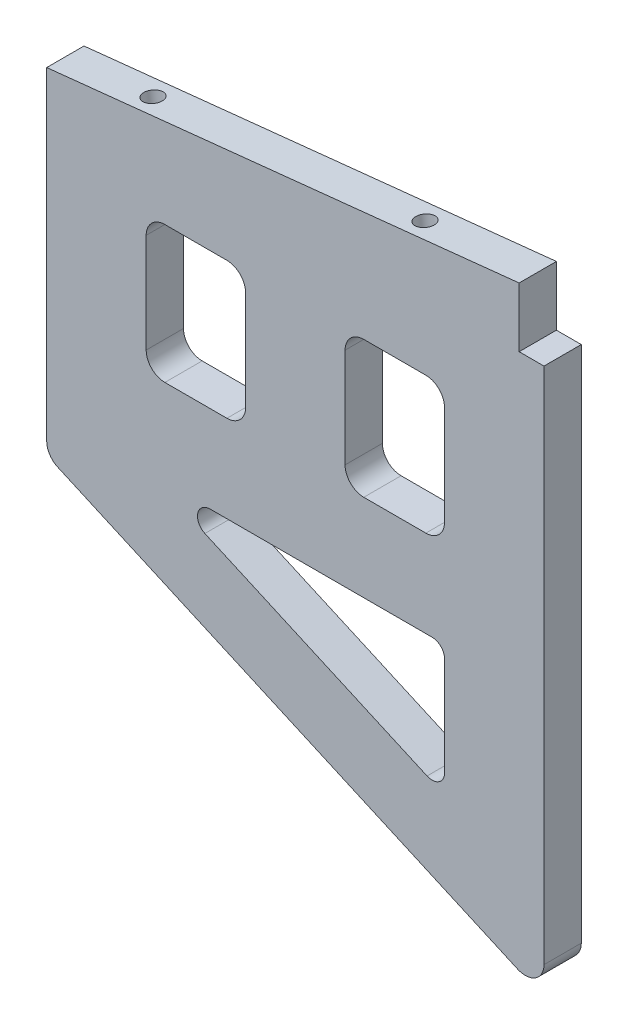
ISO-10303-21;
HEADER;
FILE_DESCRIPTION(('STEP AP214'),'2;1');
FILE_NAME('part.step','',(''),(''),'','','');
FILE_SCHEMA(('AUTOMOTIVE_DESIGN { 1 0 10303 214 1 1 1 1 }'));
ENDSEC;
DATA;
#1=APPLICATION_CONTEXT('core data for automotive mechanical design processes');
#2=APPLICATION_PROTOCOL_DEFINITION('international standard','automotive_design',2000,#1);
#3=PRODUCT_CONTEXT('',#1,'mechanical');
#4=PRODUCT('Part','Part','',(#3));
#5=PRODUCT_RELATED_PRODUCT_CATEGORY('part','',(#4));
#6=PRODUCT_DEFINITION_FORMATION('','',#4);
#7=PRODUCT_DEFINITION_CONTEXT('part definition',#1,'design');
#8=PRODUCT_DEFINITION('design','',#6,#7);
#9=PRODUCT_DEFINITION_SHAPE('','',#8);
#10=(LENGTH_UNIT() NAMED_UNIT(*) SI_UNIT(.MILLI.,.METRE.));
#11=(NAMED_UNIT(*) PLANE_ANGLE_UNIT() SI_UNIT($,.RADIAN.));
#12=(NAMED_UNIT(*) SI_UNIT($,.STERADIAN.) SOLID_ANGLE_UNIT());
#13=UNCERTAINTY_MEASURE_WITH_UNIT(LENGTH_MEASURE(1.E-05),#10,'distance_accuracy_value','');
#14=(GEOMETRIC_REPRESENTATION_CONTEXT(3) GLOBAL_UNCERTAINTY_ASSIGNED_CONTEXT((#13)) GLOBAL_UNIT_ASSIGNED_CONTEXT((#10,
#11,#12)) REPRESENTATION_CONTEXT('',''));
#15=CARTESIAN_POINT('',(0.,0.,0.));
#16=DIRECTION('',(0.,0.,1.));
#17=DIRECTION('',(1.,0.,0.));
#18=AXIS2_PLACEMENT_3D('',#15,#16,#17);
#19=CARTESIAN_POINT('',(0.,0.,4.7625));
#20=DIRECTION('',(0.,0.,1.));
#21=DIRECTION('',(1.,0.,0.));
#22=AXIS2_PLACEMENT_3D('',#19,#20,#21);
#23=PLANE('',#22);
#24=DIRECTION('',(1.,0.,0.));
#25=VECTOR('',#24,1.);
#26=CARTESIAN_POINT('',(25.4,-54.5576133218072,4.7625));
#27=LINE('',#26,#25);
#28=CARTESIAN_POINT('',(30.1752,-54.5576133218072,4.7625));
#29=VERTEX_POINT('',#28);
#30=CARTESIAN_POINT('',(46.0248,-54.5576133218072,4.7625));
#31=VERTEX_POINT('',#30);
#32=EDGE_CURVE('E285',#29,#31,#27,.T.);
#33=ORIENTED_EDGE('',*,*,#32,.F.);
#34=CARTESIAN_POINT('',(30.1752,-49.7824133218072,4.7625));
#35=DIRECTION('',(0.,0.,1.));
#36=DIRECTION('',(1.,0.,0.));
#37=AXIS2_PLACEMENT_3D('',#34,#35,#36);
#38=CIRCLE('',#37,4.7752);
#39=CARTESIAN_POINT('',(25.4,-49.7824133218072,4.7625));
#40=VERTEX_POINT('',#39);
#41=EDGE_CURVE('E452',#29,#40,#38,.F.);
#42=ORIENTED_EDGE('',*,*,#41,.T.);
#43=DIRECTION('',(0.,-1.,0.));
#44=VECTOR('',#43,1.);
#45=CARTESIAN_POINT('',(25.4,-19.6326133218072,4.7625));
#46=LINE('',#45,#44);
#47=CARTESIAN_POINT('',(25.4,-24.4078133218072,4.7625));
#48=VERTEX_POINT('',#47);
#49=EDGE_CURVE('E282',#48,#40,#46,.T.);
#50=ORIENTED_EDGE('',*,*,#49,.F.);
#51=CARTESIAN_POINT('',(30.1752,-24.4078133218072,4.7625));
#52=DIRECTION('',(0.,0.,1.));
#53=DIRECTION('',(1.,0.,0.));
#54=AXIS2_PLACEMENT_3D('',#51,#52,#53);
#55=CIRCLE('',#54,4.7752);
#56=CARTESIAN_POINT('',(30.1752,-19.6326133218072,4.7625));
#57=VERTEX_POINT('',#56);
#58=EDGE_CURVE('E456',#48,#57,#55,.F.);
#59=ORIENTED_EDGE('',*,*,#58,.T.);
#60=DIRECTION('',(-1.,0.,0.));
#61=VECTOR('',#60,1.);
#62=CARTESIAN_POINT('',(50.8,-19.6326133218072,4.7625));
#63=LINE('',#62,#61);
#64=CARTESIAN_POINT('',(46.0248,-19.6326133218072,4.7625));
#65=VERTEX_POINT('',#64);
#66=EDGE_CURVE('E292',#65,#57,#63,.T.);
#67=ORIENTED_EDGE('',*,*,#66,.F.);
#68=CARTESIAN_POINT('',(46.0248,-24.4078133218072,4.7625));
#69=DIRECTION('',(0.,0.,1.));
#70=DIRECTION('',(1.,0.,0.));
#71=AXIS2_PLACEMENT_3D('',#68,#69,#70);
#72=CIRCLE('',#71,4.7752);
#73=CARTESIAN_POINT('',(50.8,-24.4078133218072,4.7625));
#74=VERTEX_POINT('',#73);
#75=EDGE_CURVE('E444',#65,#74,#72,.F.);
#76=ORIENTED_EDGE('',*,*,#75,.T.);
#77=DIRECTION('',(0.,1.,0.));
#78=VECTOR('',#77,1.);
#79=CARTESIAN_POINT('',(50.8,-54.5576133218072,4.7625));
#80=LINE('',#79,#78);
#81=CARTESIAN_POINT('',(50.8,-49.7824133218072,4.7625));
#82=VERTEX_POINT('',#81);
#83=EDGE_CURVE('E289',#82,#74,#80,.T.);
#84=ORIENTED_EDGE('',*,*,#83,.F.);
#85=CARTESIAN_POINT('',(46.0248,-49.7824133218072,4.7625));
#86=DIRECTION('',(0.,0.,1.));
#87=DIRECTION('',(1.,0.,0.));
#88=AXIS2_PLACEMENT_3D('',#85,#86,#87);
#89=CIRCLE('',#88,4.7752);
#90=EDGE_CURVE('E448',#82,#31,#89,.F.);
#91=ORIENTED_EDGE('',*,*,#90,.T.);
#92=EDGE_LOOP('',(#33,#42,#50,#59,#67,#76,#84,#91));
#93=FACE_BOUND('',#92,.T.);
#94=DIRECTION('',(0.9135454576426,-0.406736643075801,0.));
#95=VECTOR('',#94,1.);
#96=CARTESIAN_POINT('',(0.,-85.725,4.7625));
#97=LINE('',#96,#95);
#98=CARTESIAN_POINT('',(2.83295118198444,-86.9863111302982,4.7625));
#99=VERTEX_POINT('',#98);
#100=CARTESIAN_POINT('',(120.282551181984,-139.278242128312,4.7625));
#101=VERTEX_POINT('',#100);
#102=EDGE_CURVE('E326',#99,#101,#97,.T.);
#103=ORIENTED_EDGE('',*,*,#102,.T.);
#104=CARTESIAN_POINT('',(122.2248,-134.915879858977,4.7625));
#105=DIRECTION('',(0.,0.,1.));
#106=DIRECTION('',(1.,0.,0.));
#107=AXIS2_PLACEMENT_3D('',#104,#105,#106);
#108=CIRCLE('',#107,4.7752);
#109=CARTESIAN_POINT('',(127.,-134.915879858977,4.7625));
#110=VERTEX_POINT('',#109);
#111=EDGE_CURVE('E41',#101,#110,#108,.T.);
#112=ORIENTED_EDGE('',*,*,#111,.T.);
#113=DIRECTION('',(0.,1.,0.));
#114=VECTOR('',#113,1.);
#115=CARTESIAN_POINT('',(127.,-142.269043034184,4.7625));
#116=LINE('',#115,#114);
#117=CARTESIAN_POINT('',(127.,-2.52676212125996,4.7625));
#118=VERTEX_POINT('',#117);
#119=EDGE_CURVE('E329',#110,#118,#116,.T.);
#120=ORIENTED_EDGE('',*,*,#119,.T.);
#121=DIRECTION('',(-1.,0.,0.));
#122=VECTOR('',#121,1.);
#123=CARTESIAN_POINT('',(120.65,-2.52676212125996,4.7625));
#124=LINE('',#123,#122);
#125=CARTESIAN_POINT('',(120.65,-2.52676212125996,4.7625));
#126=VERTEX_POINT('',#125);
#127=EDGE_CURVE('E331',#118,#126,#124,.T.);
#128=ORIENTED_EDGE('',*,*,#127,.T.);
#129=DIRECTION('',(0.,1.,0.));
#130=VECTOR('',#129,1.);
#131=CARTESIAN_POINT('',(120.65,12.680825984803,4.7625));
#132=LINE('',#131,#130);
#133=CARTESIAN_POINT('',(120.65,12.680825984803,4.7625));
#134=VERTEX_POINT('',#133);
#135=EDGE_CURVE('E333',#126,#134,#132,.T.);
#136=ORIENTED_EDGE('',*,*,#135,.T.);
#137=DIRECTION('',(-0.994521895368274,-0.104528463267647,0.));
#138=VECTOR('',#137,1.);
#139=CARTESIAN_POINT('',(120.65,12.680825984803,4.7625));
#140=LINE('',#139,#138);
#141=CARTESIAN_POINT('',(0.,0.,4.7625));
#142=VERTEX_POINT('',#141);
#143=EDGE_CURVE('E335',#134,#142,#140,.T.);
#144=ORIENTED_EDGE('',*,*,#143,.T.);
#145=DIRECTION('',(0.,-1.,0.));
#146=VECTOR('',#145,1.);
#147=CARTESIAN_POINT('',(0.,0.,4.7625));
#148=LINE('',#147,#146);
#149=CARTESIAN_POINT('',(0.,-82.6239488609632,4.7625));
#150=VERTEX_POINT('',#149);
#151=EDGE_CURVE('E324',#142,#150,#148,.T.);
#152=ORIENTED_EDGE('',*,*,#151,.T.);
#153=CARTESIAN_POINT('',(4.77520000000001,-82.6239488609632,4.7625));
#154=DIRECTION('',(0.,0.,1.));
#155=DIRECTION('',(1.,0.,0.));
#156=AXIS2_PLACEMENT_3D('',#153,#154,#155);
#157=CIRCLE('',#156,4.7752);
#158=EDGE_CURVE('E469',#150,#99,#157,.T.);
#159=ORIENTED_EDGE('',*,*,#158,.T.);
#160=EDGE_LOOP('',(#103,#112,#120,#128,#136,#144,#152,#159));
#161=FACE_BOUND('',#160,.T.);
#162=DIRECTION('',(0.9135454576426,-0.406736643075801,0.));
#163=VECTOR('',#162,1.);
#164=CARTESIAN_POINT('',(26.751273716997,-76.7826133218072,4.7625));
#165=LINE('',#164,#163);
#166=CARTESIAN_POINT('',(40.3970854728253,-82.8581201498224,4.7625));
#167=VERTEX_POINT('',#166);
#168=CARTESIAN_POINT('',(97.1336111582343,-108.118848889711,4.7625));
#169=VERTEX_POINT('',#168);
#170=EDGE_CURVE('E309',#167,#169,#165,.T.);
#171=ORIENTED_EDGE('',*,*,#170,.F.);
#172=CARTESIAN_POINT('',(41.688474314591,-79.9576133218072,4.7625));
#173=DIRECTION('',(0.,0.,1.));
#174=DIRECTION('',(1.,0.,0.));
#175=AXIS2_PLACEMENT_3D('',#172,#173,#174);
#176=CIRCLE('',#175,3.175);
#177=CARTESIAN_POINT('',(41.688474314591,-76.7826133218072,4.7625));
#178=VERTEX_POINT('',#177);
#179=EDGE_CURVE('E384',#167,#178,#176,.F.);
#180=ORIENTED_EDGE('',*,*,#179,.T.);
#181=DIRECTION('',(-1.,0.,0.));
#182=VECTOR('',#181,1.);
#183=CARTESIAN_POINT('',(101.6,-76.7826133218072,4.7625));
#184=LINE('',#183,#182);
#185=CARTESIAN_POINT('',(98.425,-76.7826133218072,4.7625));
#186=VERTEX_POINT('',#185);
#187=EDGE_CURVE('E306',#186,#178,#184,.T.);
#188=ORIENTED_EDGE('',*,*,#187,.F.);
#189=CARTESIAN_POINT('',(98.425,-79.9576133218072,4.7625));
#190=DIRECTION('',(0.,0.,1.));
#191=DIRECTION('',(1.,0.,0.));
#192=AXIS2_PLACEMENT_3D('',#189,#190,#191);
#193=CIRCLE('',#192,3.175);
#194=CARTESIAN_POINT('',(101.6,-79.9576133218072,4.7625));
#195=VERTEX_POINT('',#194);
#196=EDGE_CURVE('E376',#186,#195,#193,.F.);
#197=ORIENTED_EDGE('',*,*,#196,.T.);
#198=DIRECTION('',(0.,1.,0.));
#199=VECTOR('',#198,1.);
#200=CARTESIAN_POINT('',(101.6,-110.107413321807,4.7625));
#201=LINE('',#200,#199);
#202=CARTESIAN_POINT('',(101.6,-105.218342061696,4.7625));
#203=VERTEX_POINT('',#202);
#204=EDGE_CURVE('E313',#203,#195,#201,.T.);
#205=ORIENTED_EDGE('',*,*,#204,.F.);
#206=CARTESIAN_POINT('',(98.425,-105.218342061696,4.7625));
#207=DIRECTION('',(0.,0.,1.));
#208=DIRECTION('',(1.,0.,0.));
#209=AXIS2_PLACEMENT_3D('',#206,#207,#208);
#210=CIRCLE('',#209,3.175);
#211=EDGE_CURVE('E380',#203,#169,#210,.F.);
#212=ORIENTED_EDGE('',*,*,#211,.T.);
#213=EDGE_LOOP('',(#171,#180,#188,#197,#205,#212));
#214=FACE_BOUND('',#213,.T.);
#215=DIRECTION('',(1.,0.,0.));
#216=VECTOR('',#215,1.);
#217=CARTESIAN_POINT('',(76.2,-54.5576133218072,4.7625));
#218=LINE('',#217,#216);
#219=CARTESIAN_POINT('',(80.9752,-54.5576133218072,4.7625));
#220=VERTEX_POINT('',#219);
#221=CARTESIAN_POINT('',(96.8248,-54.5576133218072,4.7625));
#222=VERTEX_POINT('',#221);
#223=EDGE_CURVE('E261',#220,#222,#218,.T.);
#224=ORIENTED_EDGE('',*,*,#223,.F.);
#225=CARTESIAN_POINT('',(80.9752,-49.7824133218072,4.7625));
#226=DIRECTION('',(0.,0.,1.));
#227=DIRECTION('',(1.,0.,0.));
#228=AXIS2_PLACEMENT_3D('',#225,#226,#227);
#229=CIRCLE('',#228,4.7752);
#230=CARTESIAN_POINT('',(76.2,-49.7824133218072,4.7625));
#231=VERTEX_POINT('',#230);
#232=EDGE_CURVE('E436',#220,#231,#229,.F.);
#233=ORIENTED_EDGE('',*,*,#232,.T.);
#234=DIRECTION('',(0.,-1.,0.));
#235=VECTOR('',#234,1.);
#236=CARTESIAN_POINT('',(76.2,-19.6326133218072,4.7625));
#237=LINE('',#236,#235);
#238=CARTESIAN_POINT('',(76.2,-24.4078133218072,4.7625));
#239=VERTEX_POINT('',#238);
#240=EDGE_CURVE('E258',#239,#231,#237,.T.);
#241=ORIENTED_EDGE('',*,*,#240,.F.);
#242=CARTESIAN_POINT('',(80.9752,-24.4078133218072,4.7625));
#243=DIRECTION('',(0.,0.,1.));
#244=DIRECTION('',(1.,0.,0.));
#245=AXIS2_PLACEMENT_3D('',#242,#243,#244);
#246=CIRCLE('',#245,4.7752);
#247=CARTESIAN_POINT('',(80.9752,-19.6326133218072,4.7625));
#248=VERTEX_POINT('',#247);
#249=EDGE_CURVE('E440',#239,#248,#246,.F.);
#250=ORIENTED_EDGE('',*,*,#249,.T.);
#251=DIRECTION('',(-1.,0.,0.));
#252=VECTOR('',#251,1.);
#253=CARTESIAN_POINT('',(101.6,-19.6326133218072,4.7625));
#254=LINE('',#253,#252);
#255=CARTESIAN_POINT('',(96.8248,-19.6326133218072,4.7625));
#256=VERTEX_POINT('',#255);
#257=EDGE_CURVE('E268',#256,#248,#254,.T.);
#258=ORIENTED_EDGE('',*,*,#257,.F.);
#259=CARTESIAN_POINT('',(96.8248,-24.4078133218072,4.7625));
#260=DIRECTION('',(0.,0.,1.));
#261=DIRECTION('',(1.,0.,0.));
#262=AXIS2_PLACEMENT_3D('',#259,#260,#261);
#263=CIRCLE('',#262,4.7752);
#264=CARTESIAN_POINT('',(101.6,-24.4078133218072,4.7625));
#265=VERTEX_POINT('',#264);
#266=EDGE_CURVE('E428',#256,#265,#263,.F.);
#267=ORIENTED_EDGE('',*,*,#266,.T.);
#268=DIRECTION('',(0.,1.,0.));
#269=VECTOR('',#268,1.);
#270=CARTESIAN_POINT('',(101.6,-54.5576133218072,4.7625));
#271=LINE('',#270,#269);
#272=CARTESIAN_POINT('',(101.6,-49.7824133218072,4.7625));
#273=VERTEX_POINT('',#272);
#274=EDGE_CURVE('E265',#273,#265,#271,.T.);
#275=ORIENTED_EDGE('',*,*,#274,.F.);
#276=CARTESIAN_POINT('',(96.8248,-49.7824133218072,4.7625));
#277=DIRECTION('',(0.,0.,1.));
#278=DIRECTION('',(1.,0.,0.));
#279=AXIS2_PLACEMENT_3D('',#276,#277,#278);
#280=CIRCLE('',#279,4.7752);
#281=EDGE_CURVE('E432',#273,#222,#280,.F.);
#282=ORIENTED_EDGE('',*,*,#281,.T.);
#283=EDGE_LOOP('',(#224,#233,#241,#250,#258,#267,#275,#282));
#284=FACE_BOUND('',#283,.T.);
#285=ADVANCED_FACE('F33',(#93,#161,#214,#284),#23,.T.);
#286=CARTESIAN_POINT('',(0.,0.,-4.7625));
#287=DIRECTION('',(0.,0.,1.));
#288=DIRECTION('',(1.,0.,0.));
#289=AXIS2_PLACEMENT_3D('',#286,#287,#288);
#290=PLANE('',#289);
#291=DIRECTION('',(-1.,0.,0.));
#292=VECTOR('',#291,1.);
#293=CARTESIAN_POINT('',(50.8,-19.6326133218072,-4.7625));
#294=LINE('',#293,#292);
#295=CARTESIAN_POINT('',(46.0248,-19.6326133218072,-4.7625));
#296=VERTEX_POINT('',#295);
#297=CARTESIAN_POINT('',(30.1752,-19.6326133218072,-4.7625));
#298=VERTEX_POINT('',#297);
#299=EDGE_CURVE('E286',#296,#298,#294,.T.);
#300=ORIENTED_EDGE('',*,*,#299,.T.);
#301=CARTESIAN_POINT('',(30.1752,-24.4078133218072,-4.7625));
#302=DIRECTION('',(0.,0.,1.));
#303=DIRECTION('',(1.,0.,0.));
#304=AXIS2_PLACEMENT_3D('',#301,#302,#303);
#305=CIRCLE('',#304,4.7752);
#306=CARTESIAN_POINT('',(25.4,-24.4078133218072,-4.7625));
#307=VERTEX_POINT('',#306);
#308=EDGE_CURVE('E454',#298,#307,#305,.T.);
#309=ORIENTED_EDGE('',*,*,#308,.T.);
#310=DIRECTION('',(0.,-1.,0.));
#311=VECTOR('',#310,1.);
#312=CARTESIAN_POINT('',(25.4,-19.6326133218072,-4.7625));
#313=LINE('',#312,#311);
#314=CARTESIAN_POINT('',(25.4,-49.7824133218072,-4.7625));
#315=VERTEX_POINT('',#314);
#316=EDGE_CURVE('E271',#307,#315,#313,.T.);
#317=ORIENTED_EDGE('',*,*,#316,.T.);
#318=CARTESIAN_POINT('',(30.1752,-49.7824133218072,-4.7625));
#319=DIRECTION('',(0.,0.,1.));
#320=DIRECTION('',(1.,0.,0.));
#321=AXIS2_PLACEMENT_3D('',#318,#319,#320);
#322=CIRCLE('',#321,4.7752);
#323=CARTESIAN_POINT('',(30.1752,-54.5576133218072,-4.7625));
#324=VERTEX_POINT('',#323);
#325=EDGE_CURVE('E450',#315,#324,#322,.T.);
#326=ORIENTED_EDGE('',*,*,#325,.T.);
#327=DIRECTION('',(1.,0.,0.));
#328=VECTOR('',#327,1.);
#329=CARTESIAN_POINT('',(25.4,-54.5576133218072,-4.7625));
#330=LINE('',#329,#328);
#331=CARTESIAN_POINT('',(46.0248,-54.5576133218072,-4.7625));
#332=VERTEX_POINT('',#331);
#333=EDGE_CURVE('E298',#324,#332,#330,.T.);
#334=ORIENTED_EDGE('',*,*,#333,.T.);
#335=CARTESIAN_POINT('',(46.0248,-49.7824133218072,-4.7625));
#336=DIRECTION('',(0.,0.,1.));
#337=DIRECTION('',(1.,0.,0.));
#338=AXIS2_PLACEMENT_3D('',#335,#336,#337);
#339=CIRCLE('',#338,4.7752);
#340=CARTESIAN_POINT('',(50.8,-49.7824133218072,-4.7625));
#341=VERTEX_POINT('',#340);
#342=EDGE_CURVE('E446',#332,#341,#339,.T.);
#343=ORIENTED_EDGE('',*,*,#342,.T.);
#344=DIRECTION('',(0.,1.,0.));
#345=VECTOR('',#344,1.);
#346=CARTESIAN_POINT('',(50.8,-54.5576133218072,-4.7625));
#347=LINE('',#346,#345);
#348=CARTESIAN_POINT('',(50.8,-24.4078133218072,-4.7625));
#349=VERTEX_POINT('',#348);
#350=EDGE_CURVE('E301',#341,#349,#347,.T.);
#351=ORIENTED_EDGE('',*,*,#350,.T.);
#352=CARTESIAN_POINT('',(46.0248,-24.4078133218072,-4.7625));
#353=DIRECTION('',(0.,0.,1.));
#354=DIRECTION('',(1.,0.,0.));
#355=AXIS2_PLACEMENT_3D('',#352,#353,#354);
#356=CIRCLE('',#355,4.7752);
#357=EDGE_CURVE('E442',#349,#296,#356,.T.);
#358=ORIENTED_EDGE('',*,*,#357,.T.);
#359=EDGE_LOOP('',(#300,#309,#317,#326,#334,#343,#351,#358));
#360=FACE_BOUND('',#359,.T.);
#361=DIRECTION('',(0.,1.,0.));
#362=VECTOR('',#361,1.);
#363=CARTESIAN_POINT('',(127.,-142.269043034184,-4.7625));
#364=LINE('',#363,#362);
#365=CARTESIAN_POINT('',(127.,-134.915879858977,-4.7625));
#366=VERTEX_POINT('',#365);
#367=CARTESIAN_POINT('',(127.,-2.52676212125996,-4.7625));
#368=VERTEX_POINT('',#367);
#369=EDGE_CURVE('E341',#366,#368,#364,.T.);
#370=ORIENTED_EDGE('',*,*,#369,.F.);
#371=CARTESIAN_POINT('',(122.2248,-134.915879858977,-4.7625));
#372=DIRECTION('',(0.,0.,1.));
#373=DIRECTION('',(1.,0.,0.));
#374=AXIS2_PLACEMENT_3D('',#371,#372,#373);
#375=CIRCLE('',#374,4.7752);
#376=CARTESIAN_POINT('',(120.282551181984,-139.278242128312,-4.7625));
#377=VERTEX_POINT('',#376);
#378=EDGE_CURVE('E463',#366,#377,#375,.F.);
#379=ORIENTED_EDGE('',*,*,#378,.T.);
#380=DIRECTION('',(0.9135454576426,-0.406736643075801,0.));
#381=VECTOR('',#380,1.);
#382=CARTESIAN_POINT('',(0.,-85.725,-4.7625));
#383=LINE('',#382,#381);
#384=CARTESIAN_POINT('',(2.83295118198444,-86.9863111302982,-4.7625));
#385=VERTEX_POINT('',#384);
#386=EDGE_CURVE('E339',#385,#377,#383,.T.);
#387=ORIENTED_EDGE('',*,*,#386,.F.);
#388=CARTESIAN_POINT('',(4.77520000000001,-82.6239488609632,-4.7625));
#389=DIRECTION('',(0.,0.,1.));
#390=DIRECTION('',(1.,0.,0.));
#391=AXIS2_PLACEMENT_3D('',#388,#389,#390);
#392=CIRCLE('',#391,4.7752);
#393=CARTESIAN_POINT('',(0.,-82.6239488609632,-4.7625));
#394=VERTEX_POINT('',#393);
#395=EDGE_CURVE('E461',#385,#394,#392,.F.);
#396=ORIENTED_EDGE('',*,*,#395,.T.);
#397=DIRECTION('',(0.,-1.,0.));
#398=VECTOR('',#397,1.);
#399=CARTESIAN_POINT('',(0.,0.,-4.7625));
#400=LINE('',#399,#398);
#401=CARTESIAN_POINT('',(0.,0.,-4.7625));
#402=VERTEX_POINT('',#401);
#403=EDGE_CURVE('E316',#402,#394,#400,.T.);
#404=ORIENTED_EDGE('',*,*,#403,.F.);
#405=DIRECTION('',(-0.994521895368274,-0.104528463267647,0.));
#406=VECTOR('',#405,1.);
#407=CARTESIAN_POINT('',(120.65,12.680825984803,-4.7625));
#408=LINE('',#407,#406);
#409=CARTESIAN_POINT('',(120.65,12.680825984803,-4.7625));
#410=VERTEX_POINT('',#409);
#411=EDGE_CURVE('E327',#410,#402,#408,.T.);
#412=ORIENTED_EDGE('',*,*,#411,.F.);
#413=DIRECTION('',(0.,1.,0.));
#414=VECTOR('',#413,1.);
#415=CARTESIAN_POINT('',(120.65,12.680825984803,-4.7625));
#416=LINE('',#415,#414);
#417=CARTESIAN_POINT('',(120.65,-2.52676212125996,-4.7625));
#418=VERTEX_POINT('',#417);
#419=EDGE_CURVE('E345',#418,#410,#416,.T.);
#420=ORIENTED_EDGE('',*,*,#419,.F.);
#421=DIRECTION('',(-1.,0.,0.));
#422=VECTOR('',#421,1.);
#423=CARTESIAN_POINT('',(120.65,-2.52676212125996,-4.7625));
#424=LINE('',#423,#422);
#425=EDGE_CURVE('E343',#368,#418,#424,.T.);
#426=ORIENTED_EDGE('',*,*,#425,.F.);
#427=EDGE_LOOP('',(#370,#379,#387,#396,#404,#412,#420,#426));
#428=FACE_BOUND('',#427,.T.);
#429=DIRECTION('',(0.,1.,0.));
#430=VECTOR('',#429,1.);
#431=CARTESIAN_POINT('',(101.6,-110.107413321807,-4.7625));
#432=LINE('',#431,#430);
#433=CARTESIAN_POINT('',(101.6,-105.218342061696,-4.7625));
#434=VERTEX_POINT('',#433);
#435=CARTESIAN_POINT('',(101.6,-79.9576133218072,-4.7625));
#436=VERTEX_POINT('',#435);
#437=EDGE_CURVE('E310',#434,#436,#432,.T.);
#438=ORIENTED_EDGE('',*,*,#437,.T.);
#439=CARTESIAN_POINT('',(98.425,-79.9576133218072,-4.7625));
#440=DIRECTION('',(0.,0.,1.));
#441=DIRECTION('',(1.,0.,0.));
#442=AXIS2_PLACEMENT_3D('',#439,#440,#441);
#443=CIRCLE('',#442,3.175);
#444=CARTESIAN_POINT('',(98.425,-76.7826133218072,-4.7625));
#445=VERTEX_POINT('',#444);
#446=EDGE_CURVE('E374',#436,#445,#443,.T.);
#447=ORIENTED_EDGE('',*,*,#446,.T.);
#448=DIRECTION('',(-1.,0.,0.));
#449=VECTOR('',#448,1.);
#450=CARTESIAN_POINT('',(101.6,-76.7826133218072,-4.7625));
#451=LINE('',#450,#449);
#452=CARTESIAN_POINT('',(41.688474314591,-76.7826133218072,-4.7625));
#453=VERTEX_POINT('',#452);
#454=EDGE_CURVE('E295',#445,#453,#451,.T.);
#455=ORIENTED_EDGE('',*,*,#454,.T.);
#456=CARTESIAN_POINT('',(41.688474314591,-79.9576133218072,-4.7625));
#457=DIRECTION('',(0.,0.,1.));
#458=DIRECTION('',(1.,0.,0.));
#459=AXIS2_PLACEMENT_3D('',#456,#457,#458);
#460=CIRCLE('',#459,3.175);
#461=CARTESIAN_POINT('',(40.3970854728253,-82.8581201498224,-4.7625));
#462=VERTEX_POINT('',#461);
#463=EDGE_CURVE('E382',#453,#462,#460,.T.);
#464=ORIENTED_EDGE('',*,*,#463,.T.);
#465=DIRECTION('',(0.9135454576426,-0.406736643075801,0.));
#466=VECTOR('',#465,1.);
#467=CARTESIAN_POINT('',(26.751273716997,-76.7826133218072,-4.7625));
#468=LINE('',#467,#466);
#469=CARTESIAN_POINT('',(97.1336111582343,-108.118848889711,-4.7625));
#470=VERTEX_POINT('',#469);
#471=EDGE_CURVE('E319',#462,#470,#468,.T.);
#472=ORIENTED_EDGE('',*,*,#471,.T.);
#473=CARTESIAN_POINT('',(98.425,-105.218342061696,-4.7625));
#474=DIRECTION('',(0.,0.,1.));
#475=DIRECTION('',(1.,0.,0.));
#476=AXIS2_PLACEMENT_3D('',#473,#474,#475);
#477=CIRCLE('',#476,3.175);
#478=EDGE_CURVE('E378',#470,#434,#477,.T.);
#479=ORIENTED_EDGE('',*,*,#478,.T.);
#480=EDGE_LOOP('',(#438,#447,#455,#464,#472,#479));
#481=FACE_BOUND('',#480,.T.);
#482=DIRECTION('',(-1.,0.,0.));
#483=VECTOR('',#482,1.);
#484=CARTESIAN_POINT('',(101.6,-19.6326133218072,-4.7625));
#485=LINE('',#484,#483);
#486=CARTESIAN_POINT('',(96.8248,-19.6326133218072,-4.7625));
#487=VERTEX_POINT('',#486);
#488=CARTESIAN_POINT('',(80.9752,-19.6326133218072,-4.7625));
#489=VERTEX_POINT('',#488);
#490=EDGE_CURVE('E262',#487,#489,#485,.T.);
#491=ORIENTED_EDGE('',*,*,#490,.T.);
#492=CARTESIAN_POINT('',(80.9752,-24.4078133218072,-4.7625));
#493=DIRECTION('',(0.,0.,1.));
#494=DIRECTION('',(1.,0.,0.));
#495=AXIS2_PLACEMENT_3D('',#492,#493,#494);
#496=CIRCLE('',#495,4.7752);
#497=CARTESIAN_POINT('',(76.2,-24.4078133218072,-4.7625));
#498=VERTEX_POINT('',#497);
#499=EDGE_CURVE('E438',#489,#498,#496,.T.);
#500=ORIENTED_EDGE('',*,*,#499,.T.);
#501=DIRECTION('',(0.,-1.,0.));
#502=VECTOR('',#501,1.);
#503=CARTESIAN_POINT('',(76.2,-19.6326133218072,-4.7625));
#504=LINE('',#503,#502);
#505=CARTESIAN_POINT('',(76.2,-49.7824133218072,-4.7625));
#506=VERTEX_POINT('',#505);
#507=EDGE_CURVE('E257',#498,#506,#504,.T.);
#508=ORIENTED_EDGE('',*,*,#507,.T.);
#509=CARTESIAN_POINT('',(80.9752,-49.7824133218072,-4.7625));
#510=DIRECTION('',(0.,0.,1.));
#511=DIRECTION('',(1.,0.,0.));
#512=AXIS2_PLACEMENT_3D('',#509,#510,#511);
#513=CIRCLE('',#512,4.7752);
#514=CARTESIAN_POINT('',(80.9752,-54.5576133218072,-4.7625));
#515=VERTEX_POINT('',#514);
#516=EDGE_CURVE('E434',#506,#515,#513,.T.);
#517=ORIENTED_EDGE('',*,*,#516,.T.);
#518=DIRECTION('',(1.,0.,0.));
#519=VECTOR('',#518,1.);
#520=CARTESIAN_POINT('',(76.2,-54.5576133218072,-4.7625));
#521=LINE('',#520,#519);
#522=CARTESIAN_POINT('',(96.8248,-54.5576133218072,-4.7625));
#523=VERTEX_POINT('',#522);
#524=EDGE_CURVE('E274',#515,#523,#521,.T.);
#525=ORIENTED_EDGE('',*,*,#524,.T.);
#526=CARTESIAN_POINT('',(96.8248,-49.7824133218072,-4.7625));
#527=DIRECTION('',(0.,0.,1.));
#528=DIRECTION('',(1.,0.,0.));
#529=AXIS2_PLACEMENT_3D('',#526,#527,#528);
#530=CIRCLE('',#529,4.7752);
#531=CARTESIAN_POINT('',(101.6,-49.7824133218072,-4.7625));
#532=VERTEX_POINT('',#531);
#533=EDGE_CURVE('E430',#523,#532,#530,.T.);
#534=ORIENTED_EDGE('',*,*,#533,.T.);
#535=DIRECTION('',(0.,1.,0.));
#536=VECTOR('',#535,1.);
#537=CARTESIAN_POINT('',(101.6,-54.5576133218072,-4.7625));
#538=LINE('',#537,#536);
#539=CARTESIAN_POINT('',(101.6,-24.4078133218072,-4.7625));
#540=VERTEX_POINT('',#539);
#541=EDGE_CURVE('E277',#532,#540,#538,.T.);
#542=ORIENTED_EDGE('',*,*,#541,.T.);
#543=CARTESIAN_POINT('',(96.8248,-24.4078133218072,-4.7625));
#544=DIRECTION('',(0.,0.,1.));
#545=DIRECTION('',(1.,0.,0.));
#546=AXIS2_PLACEMENT_3D('',#543,#544,#545);
#547=CIRCLE('',#546,4.7752);
#548=EDGE_CURVE('E426',#540,#487,#547,.T.);
#549=ORIENTED_EDGE('',*,*,#548,.T.);
#550=EDGE_LOOP('',(#491,#500,#508,#517,#525,#534,#542,#549));
#551=FACE_BOUND('',#550,.T.);
#552=ADVANCED_FACE('F484',(#360,#428,#481,#551),#290,.F.);
#553=CARTESIAN_POINT('',(0.,0.,4.7625));
#554=DIRECTION('',(1.,0.,0.));
#555=DIRECTION('',(0.,1.,0.));
#556=AXIS2_PLACEMENT_3D('',#553,#554,#555);
#557=PLANE('',#556);
#558=ORIENTED_EDGE('',*,*,#403,.T.);
#559=DIRECTION('',(0.,0.,-1.));
#560=VECTOR('',#559,1.);
#561=CARTESIAN_POINT('',(0.,-82.6239488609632,4.7625));
#562=LINE('',#561,#560);
#563=EDGE_CURVE('E11',#394,#150,#562,.F.);
#564=ORIENTED_EDGE('',*,*,#563,.T.);
#565=ORIENTED_EDGE('',*,*,#151,.F.);
#566=DIRECTION('',(0.,0.,-1.));
#567=VECTOR('',#566,1.);
#568=CARTESIAN_POINT('',(0.,0.,4.7625));
#569=LINE('',#568,#567);
#570=EDGE_CURVE('E337',#142,#402,#569,.T.);
#571=ORIENTED_EDGE('',*,*,#570,.T.);
#572=EDGE_LOOP('',(#558,#564,#565,#571));
#573=FACE_BOUND('',#572,.T.);
#574=ADVANCED_FACE('F493',(#573),#557,.F.);
#575=CARTESIAN_POINT('',(0.,-85.725,4.7625));
#576=DIRECTION('',(0.406736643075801,0.913545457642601,0.));
#577=DIRECTION('',(-0.9135454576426,0.406736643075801,0.));
#578=AXIS2_PLACEMENT_3D('',#575,#576,#577);
#579=PLANE('',#578);
#580=ORIENTED_EDGE('',*,*,#386,.T.);
#581=DIRECTION('',(0.,0.,-1.));
#582=VECTOR('',#581,1.);
#583=CARTESIAN_POINT('',(120.282551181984,-139.278242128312,4.7625));
#584=LINE('',#583,#582);
#585=EDGE_CURVE('E54',#377,#101,#584,.F.);
#586=ORIENTED_EDGE('',*,*,#585,.T.);
#587=ORIENTED_EDGE('',*,*,#102,.F.);
#588=DIRECTION('',(0.,0.,-1.));
#589=VECTOR('',#588,1.);
#590=CARTESIAN_POINT('',(2.83295118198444,-86.9863111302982,4.7625));
#591=LINE('',#590,#589);
#592=EDGE_CURVE('E465',#99,#385,#591,.T.);
#593=ORIENTED_EDGE('',*,*,#592,.T.);
#594=EDGE_LOOP('',(#580,#586,#587,#593));
#595=FACE_BOUND('',#594,.T.);
#596=ADVANCED_FACE('F487',(#595),#579,.F.);
#597=CARTESIAN_POINT('',(127.,-142.269043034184,4.7625));
#598=DIRECTION('',(-1.,0.,0.));
#599=DIRECTION('',(0.,0.,1.));
#600=AXIS2_PLACEMENT_3D('',#597,#598,#599);
#601=PLANE('',#600);
#602=ORIENTED_EDGE('',*,*,#119,.F.);
#603=DIRECTION('',(0.,0.,-1.));
#604=VECTOR('',#603,1.);
#605=CARTESIAN_POINT('',(127.,-134.915879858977,4.7625));
#606=LINE('',#605,#604);
#607=EDGE_CURVE('E458',#110,#366,#606,.T.);
#608=ORIENTED_EDGE('',*,*,#607,.T.);
#609=ORIENTED_EDGE('',*,*,#369,.T.);
#610=DIRECTION('',(0.,0.,-1.));
#611=VECTOR('',#610,1.);
#612=CARTESIAN_POINT('',(127.,-2.52676212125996,4.7625));
#613=LINE('',#612,#611);
#614=EDGE_CURVE('E356',#118,#368,#613,.T.);
#615=ORIENTED_EDGE('',*,*,#614,.F.);
#616=EDGE_LOOP('',(#602,#608,#609,#615));
#617=FACE_BOUND('',#616,.T.);
#618=ADVANCED_FACE('F478',(#617),#601,.F.);
#619=CARTESIAN_POINT('',(120.65,-2.52676212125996,4.7625));
#620=DIRECTION('',(0.,-1.,0.));
#621=DIRECTION('',(1.,0.,0.));
#622=AXIS2_PLACEMENT_3D('',#619,#620,#621);
#623=PLANE('',#622);
#624=ORIENTED_EDGE('',*,*,#425,.T.);
#625=DIRECTION('',(0.,0.,-1.));
#626=VECTOR('',#625,1.);
#627=CARTESIAN_POINT('',(120.65,-2.52676212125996,4.7625));
#628=LINE('',#627,#626);
#629=EDGE_CURVE('E353',#126,#418,#628,.T.);
#630=ORIENTED_EDGE('',*,*,#629,.F.);
#631=ORIENTED_EDGE('',*,*,#127,.F.);
#632=ORIENTED_EDGE('',*,*,#614,.T.);
#633=EDGE_LOOP('',(#624,#630,#631,#632));
#634=FACE_BOUND('',#633,.T.);
#635=ADVANCED_FACE('F505',(#634),#623,.F.);
#636=CARTESIAN_POINT('',(120.65,12.680825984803,4.7625));
#637=DIRECTION('',(-1.,0.,0.));
#638=DIRECTION('',(0.,0.,1.));
#639=AXIS2_PLACEMENT_3D('',#636,#637,#638);
#640=PLANE('',#639);
#641=ORIENTED_EDGE('',*,*,#419,.T.);
#642=DIRECTION('',(0.,0.,-1.));
#643=VECTOR('',#642,1.);
#644=CARTESIAN_POINT('',(120.65,12.680825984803,4.7625));
#645=LINE('',#644,#643);
#646=EDGE_CURVE('E350',#134,#410,#645,.T.);
#647=ORIENTED_EDGE('',*,*,#646,.F.);
#648=ORIENTED_EDGE('',*,*,#135,.F.);
#649=ORIENTED_EDGE('',*,*,#629,.T.);
#650=EDGE_LOOP('',(#641,#647,#648,#649));
#651=FACE_BOUND('',#650,.T.);
#652=ADVANCED_FACE('F501',(#651),#640,.F.);
#653=CARTESIAN_POINT('',(120.65,12.680825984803,4.7625));
#654=DIRECTION('',(0.104528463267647,-0.994521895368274,0.));
#655=DIRECTION('',(0.994521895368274,0.104528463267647,0.));
#656=AXIS2_PLACEMENT_3D('',#653,#654,#655);
#657=PLANE('',#656);
#658=CARTESIAN_POINT('',(22.3811185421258,2.35235034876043,0.));
#659=DIRECTION('',(-0.104528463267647,0.994521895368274,0.));
#660=DIRECTION('',(-0.994521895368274,-0.104528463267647,0.));
#661=AXIS2_PLACEMENT_3D('',#658,#659,#660);
#662=CIRCLE('',#661,2.38125);
#663=CARTESIAN_POINT('',(20.0129132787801,2.10344194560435,0.));
#664=VERTEX_POINT('',#663);
#665=EDGE_CURVE('E247',#664,#664,#662,.T.);
#666=ORIENTED_EDGE('',*,*,#665,.F.);
#667=EDGE_LOOP('',(#666));
#668=FACE_BOUND('',#667,.T.);
#669=CARTESIAN_POINT('',(91.8484729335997,9.65366350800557,0.));
#670=DIRECTION('',(-0.104528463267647,0.994521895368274,0.));
#671=DIRECTION('',(-0.994521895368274,-0.104528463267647,0.));
#672=AXIS2_PLACEMENT_3D('',#669,#670,#671);
#673=CIRCLE('',#672,2.38125);
#674=CARTESIAN_POINT('',(89.480267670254,9.40475510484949,0.));
#675=VERTEX_POINT('',#674);
#676=EDGE_CURVE('E246',#675,#675,#673,.T.);
#677=ORIENTED_EDGE('',*,*,#676,.F.);
#678=EDGE_LOOP('',(#677));
#679=FACE_BOUND('',#678,.T.);
#680=ORIENTED_EDGE('',*,*,#411,.T.);
#681=ORIENTED_EDGE('',*,*,#570,.F.);
#682=ORIENTED_EDGE('',*,*,#143,.F.);
#683=ORIENTED_EDGE('',*,*,#646,.T.);
#684=EDGE_LOOP('',(#680,#681,#682,#683));
#685=FACE_BOUND('',#684,.T.);
#686=ADVANCED_FACE('F497',(#668,#679,#685),#657,.F.);
#687=CARTESIAN_POINT('',(101.6,-76.7826133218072,4.7625));
#688=DIRECTION('',(0.,-1.,0.));
#689=DIRECTION('',(1.,0.,0.));
#690=AXIS2_PLACEMENT_3D('',#687,#688,#689);
#691=PLANE('',#690);
#692=ORIENTED_EDGE('',*,*,#454,.F.);
#693=DIRECTION('',(0.,0.,-1.));
#694=VECTOR('',#693,1.);
#695=CARTESIAN_POINT('',(98.425,-76.7826133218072,4.7625));
#696=LINE('',#695,#694);
#697=EDGE_CURVE('E367',#445,#186,#696,.F.);
#698=ORIENTED_EDGE('',*,*,#697,.T.);
#699=ORIENTED_EDGE('',*,*,#187,.T.);
#700=DIRECTION('',(0.,0.,-1.));
#701=VECTOR('',#700,1.);
#702=CARTESIAN_POINT('',(41.688474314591,-76.7826133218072,-4.7625));
#703=LINE('',#702,#701);
#704=EDGE_CURVE('E364',#178,#453,#703,.T.);
#705=ORIENTED_EDGE('',*,*,#704,.T.);
#706=EDGE_LOOP('',(#692,#698,#699,#705));
#707=FACE_BOUND('',#706,.T.);
#708=ADVANCED_FACE('F524',(#707),#691,.T.);
#709=CARTESIAN_POINT('',(26.751273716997,-76.7826133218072,4.7625));
#710=DIRECTION('',(0.406736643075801,0.913545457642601,0.));
#711=DIRECTION('',(-0.913545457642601,0.406736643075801,0.));
#712=AXIS2_PLACEMENT_3D('',#709,#710,#711);
#713=PLANE('',#712);
#714=ORIENTED_EDGE('',*,*,#170,.T.);
#715=DIRECTION('',(0.,0.,-1.));
#716=VECTOR('',#715,1.);
#717=CARTESIAN_POINT('',(97.1336111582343,-108.118848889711,-4.7625));
#718=LINE('',#717,#716);
#719=EDGE_CURVE('E371',#169,#470,#718,.T.);
#720=ORIENTED_EDGE('',*,*,#719,.T.);
#721=ORIENTED_EDGE('',*,*,#471,.F.);
#722=DIRECTION('',(0.,0.,-1.));
#723=VECTOR('',#722,1.);
#724=CARTESIAN_POINT('',(40.3970854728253,-82.8581201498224,4.7625));
#725=LINE('',#724,#723);
#726=EDGE_CURVE('E369',#462,#167,#725,.F.);
#727=ORIENTED_EDGE('',*,*,#726,.T.);
#728=EDGE_LOOP('',(#714,#720,#721,#727));
#729=FACE_BOUND('',#728,.T.);
#730=ADVANCED_FACE('F532',(#729),#713,.T.);
#731=CARTESIAN_POINT('',(101.6,-110.107413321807,4.7625));
#732=DIRECTION('',(-1.,0.,0.));
#733=DIRECTION('',(0.,0.,1.));
#734=AXIS2_PLACEMENT_3D('',#731,#732,#733);
#735=PLANE('',#734);
#736=ORIENTED_EDGE('',*,*,#204,.T.);
#737=DIRECTION('',(0.,0.,-1.));
#738=VECTOR('',#737,1.);
#739=CARTESIAN_POINT('',(101.6,-79.9576133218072,-4.7625));
#740=LINE('',#739,#738);
#741=EDGE_CURVE('E361',#195,#436,#740,.T.);
#742=ORIENTED_EDGE('',*,*,#741,.T.);
#743=ORIENTED_EDGE('',*,*,#437,.F.);
#744=DIRECTION('',(0.,0.,-1.));
#745=VECTOR('',#744,1.);
#746=CARTESIAN_POINT('',(101.6,-105.218342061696,4.7625));
#747=LINE('',#746,#745);
#748=EDGE_CURVE('E359',#434,#203,#747,.F.);
#749=ORIENTED_EDGE('',*,*,#748,.T.);
#750=EDGE_LOOP('',(#736,#742,#743,#749));
#751=FACE_BOUND('',#750,.T.);
#752=ADVANCED_FACE('F581',(#751),#735,.T.);
#753=CARTESIAN_POINT('',(25.4,-19.6326133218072,4.7625));
#754=DIRECTION('',(1.,0.,0.));
#755=DIRECTION('',(0.,1.,0.));
#756=AXIS2_PLACEMENT_3D('',#753,#754,#755);
#757=PLANE('',#756);
#758=ORIENTED_EDGE('',*,*,#49,.T.);
#759=DIRECTION('',(0.,0.,-1.));
#760=VECTOR('',#759,1.);
#761=CARTESIAN_POINT('',(25.4,-49.7824133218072,-4.7625));
#762=LINE('',#761,#760);
#763=EDGE_CURVE('E423',#40,#315,#762,.T.);
#764=ORIENTED_EDGE('',*,*,#763,.T.);
#765=ORIENTED_EDGE('',*,*,#316,.F.);
#766=DIRECTION('',(0.,0.,-1.));
#767=VECTOR('',#766,1.);
#768=CARTESIAN_POINT('',(25.4,-24.4078133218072,4.7625));
#769=LINE('',#768,#767);
#770=EDGE_CURVE('E421',#307,#48,#769,.F.);
#771=ORIENTED_EDGE('',*,*,#770,.T.);
#772=EDGE_LOOP('',(#758,#764,#765,#771));
#773=FACE_BOUND('',#772,.T.);
#774=ADVANCED_FACE('F577',(#773),#757,.T.);
#775=CARTESIAN_POINT('',(25.4,-54.5576133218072,4.7625));
#776=DIRECTION('',(0.,1.,0.));
#777=DIRECTION('',(0.,0.,1.));
#778=AXIS2_PLACEMENT_3D('',#775,#776,#777);
#779=PLANE('',#778);
#780=ORIENTED_EDGE('',*,*,#32,.T.);
#781=DIRECTION('',(0.,0.,-1.));
#782=VECTOR('',#781,1.);
#783=CARTESIAN_POINT('',(46.0248,-54.5576133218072,-4.7625));
#784=LINE('',#783,#782);
#785=EDGE_CURVE('E418',#31,#332,#784,.T.);
#786=ORIENTED_EDGE('',*,*,#785,.T.);
#787=ORIENTED_EDGE('',*,*,#333,.F.);
#788=DIRECTION('',(0.,0.,-1.));
#789=VECTOR('',#788,1.);
#790=CARTESIAN_POINT('',(30.1752,-54.5576133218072,4.7625));
#791=LINE('',#790,#789);
#792=EDGE_CURVE('E416',#324,#29,#791,.F.);
#793=ORIENTED_EDGE('',*,*,#792,.T.);
#794=EDGE_LOOP('',(#780,#786,#787,#793));
#795=FACE_BOUND('',#794,.T.);
#796=ADVANCED_FACE('F573',(#795),#779,.T.);
#797=CARTESIAN_POINT('',(50.8,-54.5576133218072,4.7625));
#798=DIRECTION('',(-1.,0.,0.));
#799=DIRECTION('',(0.,0.,1.));
#800=AXIS2_PLACEMENT_3D('',#797,#798,#799);
#801=PLANE('',#800);
#802=ORIENTED_EDGE('',*,*,#83,.T.);
#803=DIRECTION('',(0.,0.,-1.));
#804=VECTOR('',#803,1.);
#805=CARTESIAN_POINT('',(50.8,-24.4078133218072,-4.7625));
#806=LINE('',#805,#804);
#807=EDGE_CURVE('E408',#74,#349,#806,.T.);
#808=ORIENTED_EDGE('',*,*,#807,.T.);
#809=ORIENTED_EDGE('',*,*,#350,.F.);
#810=DIRECTION('',(0.,0.,-1.));
#811=VECTOR('',#810,1.);
#812=CARTESIAN_POINT('',(50.8,-49.7824133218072,4.7625));
#813=LINE('',#812,#811);
#814=EDGE_CURVE('E406',#341,#82,#813,.F.);
#815=ORIENTED_EDGE('',*,*,#814,.T.);
#816=EDGE_LOOP('',(#802,#808,#809,#815));
#817=FACE_BOUND('',#816,.T.);
#818=ADVANCED_FACE('F569',(#817),#801,.T.);
#819=CARTESIAN_POINT('',(50.8,-19.6326133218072,4.7625));
#820=DIRECTION('',(0.,-1.,0.));
#821=DIRECTION('',(1.,0.,0.));
#822=AXIS2_PLACEMENT_3D('',#819,#820,#821);
#823=PLANE('',#822);
#824=ORIENTED_EDGE('',*,*,#299,.F.);
#825=DIRECTION('',(0.,0.,-1.));
#826=VECTOR('',#825,1.);
#827=CARTESIAN_POINT('',(46.0248,-19.6326133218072,4.7625));
#828=LINE('',#827,#826);
#829=EDGE_CURVE('E414',#296,#65,#828,.F.);
#830=ORIENTED_EDGE('',*,*,#829,.T.);
#831=ORIENTED_EDGE('',*,*,#66,.T.);
#832=DIRECTION('',(0.,0.,-1.));
#833=VECTOR('',#832,1.);
#834=CARTESIAN_POINT('',(30.1752,-19.6326133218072,-4.7625));
#835=LINE('',#834,#833);
#836=EDGE_CURVE('E411',#57,#298,#835,.T.);
#837=ORIENTED_EDGE('',*,*,#836,.T.);
#838=EDGE_LOOP('',(#824,#830,#831,#837));
#839=FACE_BOUND('',#838,.T.);
#840=ADVANCED_FACE('F565',(#839),#823,.T.);
#841=CARTESIAN_POINT('',(76.2,-19.6326133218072,4.7625));
#842=DIRECTION('',(1.,0.,0.));
#843=DIRECTION('',(0.,0.,-1.));
#844=AXIS2_PLACEMENT_3D('',#841,#842,#843);
#845=PLANE('',#844);
#846=ORIENTED_EDGE('',*,*,#240,.T.);
#847=DIRECTION('',(0.,0.,-1.));
#848=VECTOR('',#847,1.);
#849=CARTESIAN_POINT('',(76.2,-49.7824133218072,-4.7625));
#850=LINE('',#849,#848);
#851=EDGE_CURVE('E403',#231,#506,#850,.T.);
#852=ORIENTED_EDGE('',*,*,#851,.T.);
#853=ORIENTED_EDGE('',*,*,#507,.F.);
#854=DIRECTION('',(0.,0.,-1.));
#855=VECTOR('',#854,1.);
#856=CARTESIAN_POINT('',(76.2,-24.4078133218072,4.7625));
#857=LINE('',#856,#855);
#858=EDGE_CURVE('E401',#498,#239,#857,.F.);
#859=ORIENTED_EDGE('',*,*,#858,.T.);
#860=EDGE_LOOP('',(#846,#852,#853,#859));
#861=FACE_BOUND('',#860,.T.);
#862=ADVANCED_FACE('F561',(#861),#845,.T.);
#863=CARTESIAN_POINT('',(76.2,-54.5576133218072,4.7625));
#864=DIRECTION('',(0.,1.,0.));
#865=DIRECTION('',(0.,0.,1.));
#866=AXIS2_PLACEMENT_3D('',#863,#864,#865);
#867=PLANE('',#866);
#868=ORIENTED_EDGE('',*,*,#223,.T.);
#869=DIRECTION('',(0.,0.,-1.));
#870=VECTOR('',#869,1.);
#871=CARTESIAN_POINT('',(96.8248,-54.5576133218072,-4.7625));
#872=LINE('',#871,#870);
#873=EDGE_CURVE('E398',#222,#523,#872,.T.);
#874=ORIENTED_EDGE('',*,*,#873,.T.);
#875=ORIENTED_EDGE('',*,*,#524,.F.);
#876=DIRECTION('',(0.,0.,-1.));
#877=VECTOR('',#876,1.);
#878=CARTESIAN_POINT('',(80.9752,-54.5576133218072,4.7625));
#879=LINE('',#878,#877);
#880=EDGE_CURVE('E396',#515,#220,#879,.F.);
#881=ORIENTED_EDGE('',*,*,#880,.T.);
#882=EDGE_LOOP('',(#868,#874,#875,#881));
#883=FACE_BOUND('',#882,.T.);
#884=ADVANCED_FACE('F557',(#883),#867,.T.);
#885=CARTESIAN_POINT('',(101.6,-54.5576133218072,4.7625));
#886=DIRECTION('',(-1.,0.,0.));
#887=DIRECTION('',(0.,0.,1.));
#888=AXIS2_PLACEMENT_3D('',#885,#886,#887);
#889=PLANE('',#888);
#890=ORIENTED_EDGE('',*,*,#274,.T.);
#891=DIRECTION('',(0.,0.,-1.));
#892=VECTOR('',#891,1.);
#893=CARTESIAN_POINT('',(101.6,-24.4078133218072,-4.7625));
#894=LINE('',#893,#892);
#895=EDGE_CURVE('E388',#265,#540,#894,.T.);
#896=ORIENTED_EDGE('',*,*,#895,.T.);
#897=ORIENTED_EDGE('',*,*,#541,.F.);
#898=DIRECTION('',(0.,0.,-1.));
#899=VECTOR('',#898,1.);
#900=CARTESIAN_POINT('',(101.6,-49.7824133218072,4.7625));
#901=LINE('',#900,#899);
#902=EDGE_CURVE('E386',#532,#273,#901,.F.);
#903=ORIENTED_EDGE('',*,*,#902,.T.);
#904=EDGE_LOOP('',(#890,#896,#897,#903));
#905=FACE_BOUND('',#904,.T.);
#906=ADVANCED_FACE('F553',(#905),#889,.T.);
#907=CARTESIAN_POINT('',(101.6,-19.6326133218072,4.7625));
#908=DIRECTION('',(0.,-1.,0.));
#909=DIRECTION('',(1.,0.,0.));
#910=AXIS2_PLACEMENT_3D('',#907,#908,#909);
#911=PLANE('',#910);
#912=ORIENTED_EDGE('',*,*,#490,.F.);
#913=DIRECTION('',(0.,0.,-1.));
#914=VECTOR('',#913,1.);
#915=CARTESIAN_POINT('',(96.8248,-19.6326133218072,4.7625));
#916=LINE('',#915,#914);
#917=EDGE_CURVE('E394',#487,#256,#916,.F.);
#918=ORIENTED_EDGE('',*,*,#917,.T.);
#919=ORIENTED_EDGE('',*,*,#257,.T.);
#920=DIRECTION('',(0.,0.,-1.));
#921=VECTOR('',#920,1.);
#922=CARTESIAN_POINT('',(80.9752,-19.6326133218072,-4.7625));
#923=LINE('',#922,#921);
#924=EDGE_CURVE('E391',#248,#489,#923,.T.);
#925=ORIENTED_EDGE('',*,*,#924,.T.);
#926=EDGE_LOOP('',(#912,#918,#919,#925));
#927=FACE_BOUND('',#926,.T.);
#928=ADVANCED_FACE('F545',(#927),#911,.T.);
#929=CARTESIAN_POINT('',(93.8397401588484,-9.29197859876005,0.));
#930=DIRECTION('',(-0.104528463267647,0.994521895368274,0.));
#931=DIRECTION('',(-0.994521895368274,-0.104528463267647,0.));
#932=AXIS2_PLACEMENT_3D('',#929,#930,#931);
#933=CONICAL_SURFACE('',#932,2.38125,1.02974425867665);
#934=CARTESIAN_POINT('',(93.9892994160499,-10.7149398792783,0.));
#935=VERTEX_POINT('',#934);
#936=VERTEX_LOOP('',#935);
#937=FACE_BOUND('',#936,.T.);
#938=CARTESIAN_POINT('',(93.8397401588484,-9.29197859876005,0.));
#939=DIRECTION('',(-0.104528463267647,0.994521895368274,0.));
#940=DIRECTION('',(-0.994521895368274,-0.104528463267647,0.));
#941=AXIS2_PLACEMENT_3D('',#938,#939,#940);
#942=CIRCLE('',#941,2.38125);
#943=CARTESIAN_POINT('',(91.4715348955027,-9.54088700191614,0.));
#944=VERTEX_POINT('',#943);
#945=EDGE_CURVE('E250',#944,#944,#942,.T.);
#946=ORIENTED_EDGE('',*,*,#945,.T.);
#947=EDGE_LOOP('',(#946));
#948=FACE_BOUND('',#947,.T.);
#949=ADVANCED_FACE('F539',(#937,#948),#933,.F.);
#950=CARTESIAN_POINT('',(91.8484729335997,9.65366350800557,0.));
#951=DIRECTION('',(-0.104528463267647,0.994521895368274,0.));
#952=DIRECTION('',(-0.994521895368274,-0.104528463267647,0.));
#953=AXIS2_PLACEMENT_3D('',#950,#951,#952);
#954=CYLINDRICAL_SURFACE('',#953,2.38125);
#955=ORIENTED_EDGE('',*,*,#945,.F.);
#956=EDGE_LOOP('',(#955));
#957=FACE_BOUND('',#956,.T.);
#958=ORIENTED_EDGE('',*,*,#676,.T.);
#959=EDGE_LOOP('',(#958));
#960=FACE_BOUND('',#959,.T.);
#961=ADVANCED_FACE('F240',(#957,#960),#954,.F.);
#962=CARTESIAN_POINT('',(24.3723857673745,-16.5932917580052,0.));
#963=DIRECTION('',(-0.104528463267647,0.994521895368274,0.));
#964=DIRECTION('',(-0.994521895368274,-0.104528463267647,0.));
#965=AXIS2_PLACEMENT_3D('',#962,#963,#964);
#966=CONICAL_SURFACE('',#965,2.38125,1.02974425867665);
#967=CARTESIAN_POINT('',(24.521945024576,-18.0162530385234,0.));
#968=VERTEX_POINT('',#967);
#969=VERTEX_LOOP('',#968);
#970=FACE_BOUND('',#969,.T.);
#971=CARTESIAN_POINT('',(24.3723857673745,-16.5932917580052,0.));
#972=DIRECTION('',(-0.104528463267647,0.994521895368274,0.));
#973=DIRECTION('',(-0.994521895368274,-0.104528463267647,0.));
#974=AXIS2_PLACEMENT_3D('',#971,#972,#973);
#975=CIRCLE('',#974,2.38125);
#976=CARTESIAN_POINT('',(22.0041805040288,-16.8422001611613,0.));
#977=VERTEX_POINT('',#976);
#978=EDGE_CURVE('E244',#977,#977,#975,.T.);
#979=ORIENTED_EDGE('',*,*,#978,.T.);
#980=EDGE_LOOP('',(#979));
#981=FACE_BOUND('',#980,.T.);
#982=ADVANCED_FACE('F236',(#970,#981),#966,.F.);
#983=CARTESIAN_POINT('',(22.3811185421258,2.35235034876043,0.));
#984=DIRECTION('',(-0.104528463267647,0.994521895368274,0.));
#985=DIRECTION('',(-0.994521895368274,-0.104528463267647,0.));
#986=AXIS2_PLACEMENT_3D('',#983,#984,#985);
#987=CYLINDRICAL_SURFACE('',#986,2.38125);
#988=ORIENTED_EDGE('',*,*,#978,.F.);
#989=EDGE_LOOP('',(#988));
#990=FACE_BOUND('',#989,.T.);
#991=ORIENTED_EDGE('',*,*,#665,.T.);
#992=EDGE_LOOP('',(#991));
#993=FACE_BOUND('',#992,.T.);
#994=ADVANCED_FACE('F239',(#990,#993),#987,.F.);
#995=CARTESIAN_POINT('',(98.425,-79.9576133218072,4.7625));
#996=DIRECTION('',(0.,0.,1.));
#997=DIRECTION('',(1.,0.,0.));
#998=AXIS2_PLACEMENT_3D('',#995,#996,#997);
#999=CYLINDRICAL_SURFACE('',#998,3.175);
#1000=ORIENTED_EDGE('',*,*,#196,.F.);
#1001=ORIENTED_EDGE('',*,*,#697,.F.);
#1002=ORIENTED_EDGE('',*,*,#446,.F.);
#1003=ORIENTED_EDGE('',*,*,#741,.F.);
#1004=EDGE_LOOP('',(#1000,#1001,#1002,#1003));
#1005=FACE_BOUND('',#1004,.T.);
#1006=ADVANCED_FACE('F604',(#1005),#999,.F.);
#1007=CARTESIAN_POINT('',(98.425,-105.218342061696,4.7625));
#1008=DIRECTION('',(0.,0.,1.));
#1009=DIRECTION('',(1.,0.,0.));
#1010=AXIS2_PLACEMENT_3D('',#1007,#1008,#1009);
#1011=CYLINDRICAL_SURFACE('',#1010,3.175);
#1012=ORIENTED_EDGE('',*,*,#211,.F.);
#1013=ORIENTED_EDGE('',*,*,#748,.F.);
#1014=ORIENTED_EDGE('',*,*,#478,.F.);
#1015=ORIENTED_EDGE('',*,*,#719,.F.);
#1016=EDGE_LOOP('',(#1012,#1013,#1014,#1015));
#1017=FACE_BOUND('',#1016,.T.);
#1018=ADVANCED_FACE('F596',(#1017),#1011,.F.);
#1019=CARTESIAN_POINT('',(41.688474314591,-79.9576133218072,4.7625));
#1020=DIRECTION('',(0.,0.,1.));
#1021=DIRECTION('',(1.,0.,0.));
#1022=AXIS2_PLACEMENT_3D('',#1019,#1020,#1021);
#1023=CYLINDRICAL_SURFACE('',#1022,3.175);
#1024=ORIENTED_EDGE('',*,*,#179,.F.);
#1025=ORIENTED_EDGE('',*,*,#726,.F.);
#1026=ORIENTED_EDGE('',*,*,#463,.F.);
#1027=ORIENTED_EDGE('',*,*,#704,.F.);
#1028=EDGE_LOOP('',(#1024,#1025,#1026,#1027));
#1029=FACE_BOUND('',#1028,.T.);
#1030=ADVANCED_FACE('F610',(#1029),#1023,.F.);
#1031=CARTESIAN_POINT('',(96.8248,-24.4078133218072,4.7625));
#1032=DIRECTION('',(0.,0.,1.));
#1033=DIRECTION('',(1.,0.,0.));
#1034=AXIS2_PLACEMENT_3D('',#1031,#1032,#1033);
#1035=CYLINDRICAL_SURFACE('',#1034,4.7752);
#1036=ORIENTED_EDGE('',*,*,#266,.F.);
#1037=ORIENTED_EDGE('',*,*,#917,.F.);
#1038=ORIENTED_EDGE('',*,*,#548,.F.);
#1039=ORIENTED_EDGE('',*,*,#895,.F.);
#1040=EDGE_LOOP('',(#1036,#1037,#1038,#1039));
#1041=FACE_BOUND('',#1040,.T.);
#1042=ADVANCED_FACE('F635',(#1041),#1035,.F.);
#1043=CARTESIAN_POINT('',(96.8248,-49.7824133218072,4.7625));
#1044=DIRECTION('',(0.,0.,1.));
#1045=DIRECTION('',(1.,0.,0.));
#1046=AXIS2_PLACEMENT_3D('',#1043,#1044,#1045);
#1047=CYLINDRICAL_SURFACE('',#1046,4.7752);
#1048=ORIENTED_EDGE('',*,*,#281,.F.);
#1049=ORIENTED_EDGE('',*,*,#902,.F.);
#1050=ORIENTED_EDGE('',*,*,#533,.F.);
#1051=ORIENTED_EDGE('',*,*,#873,.F.);
#1052=EDGE_LOOP('',(#1048,#1049,#1050,#1051));
#1053=FACE_BOUND('',#1052,.T.);
#1054=ADVANCED_FACE('F639',(#1053),#1047,.F.);
#1055=CARTESIAN_POINT('',(80.9752,-49.7824133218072,4.7625));
#1056=DIRECTION('',(0.,0.,1.));
#1057=DIRECTION('',(1.,0.,0.));
#1058=AXIS2_PLACEMENT_3D('',#1055,#1056,#1057);
#1059=CYLINDRICAL_SURFACE('',#1058,4.7752);
#1060=ORIENTED_EDGE('',*,*,#232,.F.);
#1061=ORIENTED_EDGE('',*,*,#880,.F.);
#1062=ORIENTED_EDGE('',*,*,#516,.F.);
#1063=ORIENTED_EDGE('',*,*,#851,.F.);
#1064=EDGE_LOOP('',(#1060,#1061,#1062,#1063));
#1065=FACE_BOUND('',#1064,.T.);
#1066=ADVANCED_FACE('F621',(#1065),#1059,.F.);
#1067=CARTESIAN_POINT('',(80.9752,-24.4078133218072,4.7625));
#1068=DIRECTION('',(0.,0.,1.));
#1069=DIRECTION('',(1.,0.,0.));
#1070=AXIS2_PLACEMENT_3D('',#1067,#1068,#1069);
#1071=CYLINDRICAL_SURFACE('',#1070,4.7752);
#1072=ORIENTED_EDGE('',*,*,#249,.F.);
#1073=ORIENTED_EDGE('',*,*,#858,.F.);
#1074=ORIENTED_EDGE('',*,*,#499,.F.);
#1075=ORIENTED_EDGE('',*,*,#924,.F.);
#1076=EDGE_LOOP('',(#1072,#1073,#1074,#1075));
#1077=FACE_BOUND('',#1076,.T.);
#1078=ADVANCED_FACE('F629',(#1077),#1071,.F.);
#1079=CARTESIAN_POINT('',(46.0248,-24.4078133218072,4.7625));
#1080=DIRECTION('',(0.,0.,1.));
#1081=DIRECTION('',(1.,0.,0.));
#1082=AXIS2_PLACEMENT_3D('',#1079,#1080,#1081);
#1083=CYLINDRICAL_SURFACE('',#1082,4.7752);
#1084=ORIENTED_EDGE('',*,*,#75,.F.);
#1085=ORIENTED_EDGE('',*,*,#829,.F.);
#1086=ORIENTED_EDGE('',*,*,#357,.F.);
#1087=ORIENTED_EDGE('',*,*,#807,.F.);
#1088=EDGE_LOOP('',(#1084,#1085,#1086,#1087));
#1089=FACE_BOUND('',#1088,.T.);
#1090=ADVANCED_FACE('F652',(#1089),#1083,.F.);
#1091=CARTESIAN_POINT('',(46.0248,-49.7824133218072,4.7625));
#1092=DIRECTION('',(0.,0.,1.));
#1093=DIRECTION('',(1.,0.,0.));
#1094=AXIS2_PLACEMENT_3D('',#1091,#1092,#1093);
#1095=CYLINDRICAL_SURFACE('',#1094,4.7752);
#1096=ORIENTED_EDGE('',*,*,#90,.F.);
#1097=ORIENTED_EDGE('',*,*,#814,.F.);
#1098=ORIENTED_EDGE('',*,*,#342,.F.);
#1099=ORIENTED_EDGE('',*,*,#785,.F.);
#1100=EDGE_LOOP('',(#1096,#1097,#1098,#1099));
#1101=FACE_BOUND('',#1100,.T.);
#1102=ADVANCED_FACE('F655',(#1101),#1095,.F.);
#1103=CARTESIAN_POINT('',(30.1752,-49.7824133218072,4.7625));
#1104=DIRECTION('',(0.,0.,1.));
#1105=DIRECTION('',(1.,0.,0.));
#1106=AXIS2_PLACEMENT_3D('',#1103,#1104,#1105);
#1107=CYLINDRICAL_SURFACE('',#1106,4.7752);
#1108=ORIENTED_EDGE('',*,*,#41,.F.);
#1109=ORIENTED_EDGE('',*,*,#792,.F.);
#1110=ORIENTED_EDGE('',*,*,#325,.F.);
#1111=ORIENTED_EDGE('',*,*,#763,.F.);
#1112=EDGE_LOOP('',(#1108,#1109,#1110,#1111));
#1113=FACE_BOUND('',#1112,.T.);
#1114=ADVANCED_FACE('F659',(#1113),#1107,.F.);
#1115=CARTESIAN_POINT('',(30.1752,-24.4078133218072,4.7625));
#1116=DIRECTION('',(0.,0.,1.));
#1117=DIRECTION('',(1.,0.,0.));
#1118=AXIS2_PLACEMENT_3D('',#1115,#1116,#1117);
#1119=CYLINDRICAL_SURFACE('',#1118,4.7752);
#1120=ORIENTED_EDGE('',*,*,#58,.F.);
#1121=ORIENTED_EDGE('',*,*,#770,.F.);
#1122=ORIENTED_EDGE('',*,*,#308,.F.);
#1123=ORIENTED_EDGE('',*,*,#836,.F.);
#1124=EDGE_LOOP('',(#1120,#1121,#1122,#1123));
#1125=FACE_BOUND('',#1124,.T.);
#1126=ADVANCED_FACE('F663',(#1125),#1119,.F.);
#1127=CARTESIAN_POINT('',(122.2248,-134.915879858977,4.7625));
#1128=DIRECTION('',(0.,0.,-1.));
#1129=DIRECTION('',(-1.,0.,0.));
#1130=AXIS2_PLACEMENT_3D('',#1127,#1128,#1129);
#1131=CYLINDRICAL_SURFACE('',#1130,4.7752);
#1132=ORIENTED_EDGE('',*,*,#111,.F.);
#1133=ORIENTED_EDGE('',*,*,#585,.F.);
#1134=ORIENTED_EDGE('',*,*,#378,.F.);
#1135=ORIENTED_EDGE('',*,*,#607,.F.);
#1136=EDGE_LOOP('',(#1132,#1133,#1134,#1135));
#1137=FACE_BOUND('',#1136,.T.);
#1138=ADVANCED_FACE('F481',(#1137),#1131,.T.);
#1139=CARTESIAN_POINT('',(4.77520000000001,-82.6239488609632,4.7625));
#1140=DIRECTION('',(0.,0.,-1.));
#1141=DIRECTION('',(-1.,0.,0.));
#1142=AXIS2_PLACEMENT_3D('',#1139,#1140,#1141);
#1143=CYLINDRICAL_SURFACE('',#1142,4.7752);
#1144=ORIENTED_EDGE('',*,*,#158,.F.);
#1145=ORIENTED_EDGE('',*,*,#563,.F.);
#1146=ORIENTED_EDGE('',*,*,#395,.F.);
#1147=ORIENTED_EDGE('',*,*,#592,.F.);
#1148=EDGE_LOOP('',(#1144,#1145,#1146,#1147));
#1149=FACE_BOUND('',#1148,.T.);
#1150=ADVANCED_FACE('F35',(#1149),#1143,.T.);
#1151=CLOSED_SHELL('',(#285,#552,#574,#596,#618,#635,#652,#686,#708,#730,#752,#774,#796,#818,
#840,#862,#884,#906,#928,#949,#961,#982,#994,#1006,#1018,#1030,#1042,#1054,#1066,#1078,#1090,
#1102,#1114,#1126,#1138,#1150));
#1152=MANIFOLD_SOLID_BREP('B2',#1151);
#1153=ADVANCED_BREP_SHAPE_REPRESENTATION('',(#18,#1152),#14);
#1154=SHAPE_DEFINITION_REPRESENTATION(#9,#1153);
ENDSEC;
END-ISO-10303-21;
